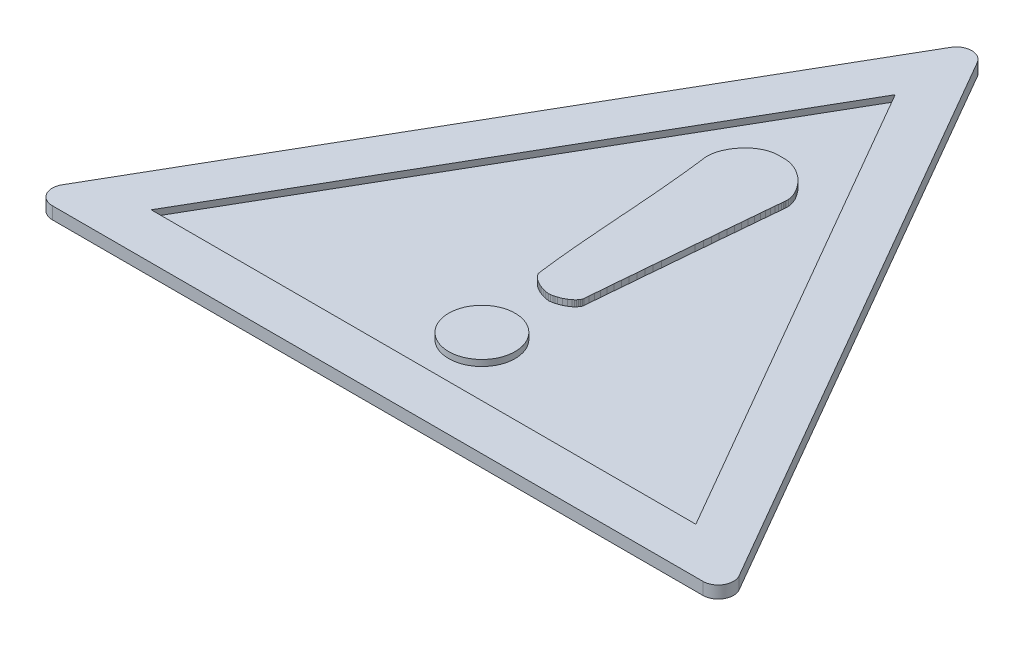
from build123d import *

# Parameters (mm, degrees)
SKIZZE1_W                       = 25
SKIZZE1_H                       = 25
LINEAR_AUSTRAGEN1_DEPTH         = 0.2
LINEAR_AUSTRAGEN_D_NN1_DEPTH    = 0.2
VERRUNDUNG1_R                   = 0.5
SKIZZE3_R                       = 1.086222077
LINEAR_AUSTRAGEN2_DEPTH         = 0.2
SKIZZE4_OUTSIDE_W               = 34.072
SKIZZE4_OUTSIDE_H               = 34.072
SCHNITT_LINEAR_AUSTRAGEN1_DEPTH = 0.4


with BuildPart() as part:
    # Skizze1 → Linear austragen1 (new body)
    with BuildSketch(Plane(origin=(0, 0, 0), x_dir=(1, 0, 0), z_dir=(0, 1, 0))):
        with Locations((0, 2.5)):
            Rectangle(SKIZZE1_W, SKIZZE1_H)
    extrude(amount=LINEAR_AUSTRAGEN1_DEPTH)

    # Skizze2 → Linear-Austragen-D_nn1 (add)
    with BuildSketch(Plane(origin=(0, 0.2, 0), x_dir=(-1, 0, 0), z_dir=(0, 1, 0))):
        Polygon((11.5, 6.639528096), (0, -13.279056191), (-11.5, 6.639528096), align=None)
        Polygon((8.901923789, 5.139528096), (0, -10.279056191), (-8.901923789, 5.139528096), align=None, mode=Mode.SUBTRACT)
    extrude(amount=LINEAR_AUSTRAGEN_D_NN1_DEPTH)

    # Verrundung1
    verrundung1_edges = [part.edges().sort_by_distance(p)[0] for p in [
        (11.5, 0.3, 6.639528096),
        (0, 0.3, -13.279056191),
        (-11.5, 0.3, 6.639528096),
    ]]
    fillet(verrundung1_edges, radius=VERRUNDUNG1_R)

    # Skizze3 → Linear austragen2 (add)
    with BuildSketch(Plane(origin=(-8.812032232, 0.2, 7.634810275), x_dir=(1, 0, 0), z_dir=(0, 1, 0))):
        with Locations(Location((8.785517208, 4.430528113, 0), (0, 0, 270))):
            Circle(SKIZZE3_R)
        Polygon((8.699117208, 14.290928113), (8.569517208, 14.290928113), (8.443517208, 14.276528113), (8.321117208, 14.244128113), (8.205917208, 14.197328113), (8.094317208, 14.136128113), (7.989917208, 14.064128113), (7.892717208, 13.981328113), (7.806317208, 13.891328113), (7.727117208, 13.790528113), (7.655117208, 13.686128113), (7.597517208, 13.578128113), (7.547117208, 13.466528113), (7.511117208, 13.351328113), (7.489517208, 13.236128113), (7.478717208, 13.124528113), (7.482317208, 13.012928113), (7.507517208, 12.825728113), (7.529117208, 12.638528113), (7.550717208, 12.454928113), (7.572317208, 12.267728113), (7.590317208, 12.080528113), (7.608317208, 11.893328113), (7.626317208, 11.709728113), (7.644317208, 11.522528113), (7.658717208, 11.335328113), (7.676717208, 11.148128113), (7.691117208, 10.960928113), (7.705517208, 10.773728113), (7.719917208, 10.590128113), (7.734317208, 10.402928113), (7.748717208, 10.215728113), (7.759517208, 10.028528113), (7.773917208, 9.841328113), (7.788317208, 9.654128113), (7.802717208, 9.466928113), (7.817117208, 9.283328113), (7.831517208, 9.096128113), (7.845917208, 8.908928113), (7.860317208, 8.721728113), (7.878317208, 8.534528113), (7.892717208, 8.347328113), (7.910717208, 8.163728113), (7.928717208, 7.976528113), (7.946717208, 7.789328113), (7.968317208, 7.602128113), (7.989917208, 7.418528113), (8.011517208, 7.231328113), (8.036717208, 7.044128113), (8.047517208, 7.008128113), (8.069117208, 6.972128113), (8.094317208, 6.932528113), (8.130317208, 6.896528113), (8.169917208, 6.860528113), (8.213117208, 6.828128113), (8.259917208, 6.795728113), (8.313917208, 6.763328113), (8.367917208, 6.734528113), (8.425517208, 6.709328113), (8.486717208, 6.684128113), (8.547917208, 6.662528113), (8.609117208, 6.644528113), (8.666717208, 6.630128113), (8.727917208, 6.622928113), (8.785517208, 6.615728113), (8.843117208, 6.622928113), (8.900717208, 6.633728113), (8.961917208, 6.648128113), (9.019517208, 6.666128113), (9.077117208, 6.687728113), (9.134717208, 6.709328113), (9.188717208, 6.738128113), (9.242717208, 6.766928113), (9.289517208, 6.799328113), (9.336317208, 6.831728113), (9.375917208, 6.867728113), (9.411917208, 6.903728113), (9.440717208, 6.939728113), (9.465917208, 6.975728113), (9.483917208, 7.015328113), (9.494717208, 7.051328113), (9.505517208, 7.206128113), (9.519917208, 7.378928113), (9.537917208, 7.562528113), (9.552317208, 7.760528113), (9.570317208, 7.969328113), (9.588317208, 8.188928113), (9.609917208, 8.415728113), (9.631517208, 8.653328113), (9.649517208, 8.894528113), (9.671117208, 9.139328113), (9.696317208, 9.391328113), (9.717917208, 9.643328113), (9.739517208, 9.895328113), (9.761117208, 10.147328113), (9.782717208, 10.399328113), (9.807917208, 10.647728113), (9.829517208, 10.888928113), (9.847517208, 11.126528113), (9.869117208, 11.356928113), (9.890717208, 11.580128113), (9.908717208, 11.792528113), (9.926717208, 11.994128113), (9.944717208, 12.184928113), (9.959117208, 12.361328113), (9.973517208, 12.519728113), (9.987917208, 12.667328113), (9.998717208, 12.793328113), (10.009517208, 12.901328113), (10.016717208, 12.991328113), (10.023917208, 13.056128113), (10.027517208, 13.099328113), (10.031117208, 13.120928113), (10.031117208, 13.207328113), (10.016717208, 13.297328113), (9.987917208, 13.394528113), (9.944717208, 13.498928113), (9.887117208, 13.599728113), (9.818717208, 13.700528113), (9.739517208, 13.801328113), (9.649517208, 13.898528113), (9.552317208, 13.988528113), (9.444317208, 14.067728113), (9.332717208, 14.143328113), (9.213917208, 14.200928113), (9.087917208, 14.247728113), (8.961917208, 14.280128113), (8.832317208, 14.294528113), align=None)
    extrude(amount=LINEAR_AUSTRAGEN2_DEPTH)

    # Skizze4 outside → Schnitt-Linear austragen1 (cut)
    with BuildSketch(Plane(origin=(0, 0.4, 0), x_dir=(-1, 0, 0), z_dir=(0, 1, 0))):
        with Locations((0, -2.5)):
            Rectangle(SKIZZE4_OUTSIDE_W, SKIZZE4_OUTSIDE_H)
        with BuildLine():
            Line((-11.066987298, 5.889528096), (-0.433012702, -12.529056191))
            ThreePointArc((-0.433012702, -12.529056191), (0, -12.779056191), (0.433012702, -12.529056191))
            Line((0.433012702, -12.529056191), (11.066987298, 5.889528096))
            ThreePointArc((11.066987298, 5.889528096), (11.066987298, 6.389528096), (10.633974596, 6.639528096))
            Line((10.633974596, 6.639528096), (-10.633974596, 6.639528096))
            ThreePointArc((-10.633974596, 6.639528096), (-11.066987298, 6.389528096), (-11.066987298, 5.889528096))
        make_face(mode=Mode.SUBTRACT)
    extrude(amount=-SCHNITT_LINEAR_AUSTRAGEN1_DEPTH, mode=Mode.SUBTRACT)


solid = part.part
